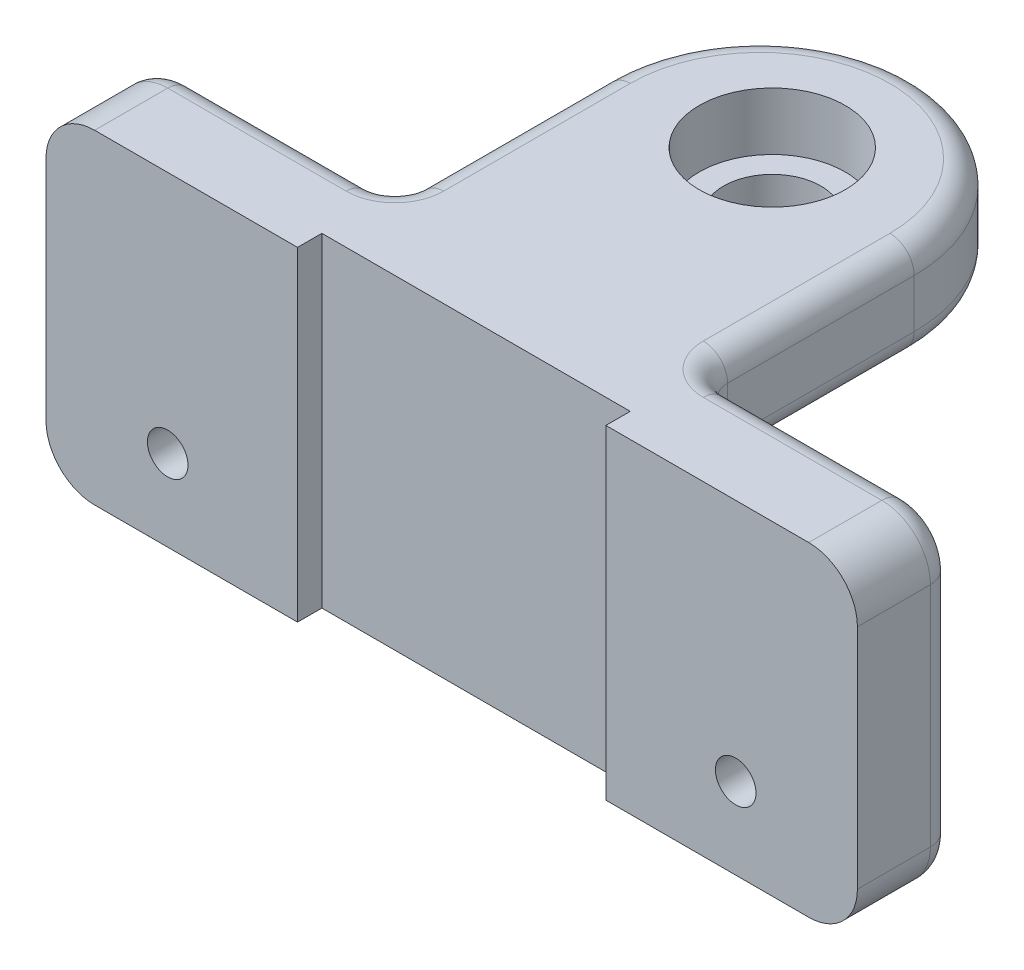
ISO-10303-21;
HEADER;
FILE_DESCRIPTION(('STEP AP214'),'2;1');
FILE_NAME('part.step','',(''),(''),'','','');
FILE_SCHEMA(('AUTOMOTIVE_DESIGN { 1 0 10303 214 1 1 1 1 }'));
ENDSEC;
DATA;
#1=APPLICATION_CONTEXT('core data for automotive mechanical design processes');
#2=APPLICATION_PROTOCOL_DEFINITION('international standard','automotive_design',2000,#1);
#3=PRODUCT_CONTEXT('',#1,'mechanical');
#4=PRODUCT('Part','Part','',(#3));
#5=PRODUCT_RELATED_PRODUCT_CATEGORY('part','',(#4));
#6=PRODUCT_DEFINITION_FORMATION('','',#4);
#7=PRODUCT_DEFINITION_CONTEXT('part definition',#1,'design');
#8=PRODUCT_DEFINITION('design','',#6,#7);
#9=PRODUCT_DEFINITION_SHAPE('','',#8);
#10=(LENGTH_UNIT() NAMED_UNIT(*) SI_UNIT(.MILLI.,.METRE.));
#11=(NAMED_UNIT(*) PLANE_ANGLE_UNIT() SI_UNIT($,.RADIAN.));
#12=(NAMED_UNIT(*) SI_UNIT($,.STERADIAN.) SOLID_ANGLE_UNIT());
#13=UNCERTAINTY_MEASURE_WITH_UNIT(LENGTH_MEASURE(1.E-05),#10,'distance_accuracy_value','');
#14=(GEOMETRIC_REPRESENTATION_CONTEXT(3) GLOBAL_UNCERTAINTY_ASSIGNED_CONTEXT((#13)) GLOBAL_UNIT_ASSIGNED_CONTEXT((#10,
#11,#12)) REPRESENTATION_CONTEXT('',''));
#15=CARTESIAN_POINT('',(0.,0.,0.));
#16=DIRECTION('',(0.,0.,1.));
#17=DIRECTION('',(1.,0.,0.));
#18=AXIS2_PLACEMENT_3D('',#15,#16,#17);
#19=CARTESIAN_POINT('',(6.,6.,12.));
#20=DIRECTION('',(0.,0.,1.));
#21=DIRECTION('',(1.,0.,0.));
#22=AXIS2_PLACEMENT_3D('',#19,#20,#21);
#23=CYLINDRICAL_SURFACE('',#22,6.);
#24=DIRECTION('',(0.,0.,1.));
#25=VECTOR('',#24,1.);
#26=CARTESIAN_POINT('',(0.,6.,12.));
#27=LINE('',#26,#25);
#28=CARTESIAN_POINT('',(0.,6.,3.));
#29=VERTEX_POINT('',#28);
#30=CARTESIAN_POINT('',(0.,6.00000000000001,12.));
#31=VERTEX_POINT('',#30);
#32=EDGE_CURVE('E337',#29,#31,#27,.T.);
#33=ORIENTED_EDGE('',*,*,#32,.F.);
#34=CARTESIAN_POINT('',(6.,6.,3.));
#35=DIRECTION('',(0.,0.,1.));
#36=DIRECTION('',(1.,0.,0.));
#37=AXIS2_PLACEMENT_3D('',#34,#35,#36);
#38=CIRCLE('',#37,6.);
#39=CARTESIAN_POINT('',(6.,0.,3.));
#40=VERTEX_POINT('',#39);
#41=EDGE_CURVE('E59',#29,#40,#38,.T.);
#42=ORIENTED_EDGE('',*,*,#41,.T.);
#43=DIRECTION('',(0.,0.,1.));
#44=VECTOR('',#43,1.);
#45=CARTESIAN_POINT('',(6.,0.,12.));
#46=LINE('',#45,#44);
#47=CARTESIAN_POINT('',(6.,0.,12.));
#48=VERTEX_POINT('',#47);
#49=EDGE_CURVE('E340',#48,#40,#46,.F.);
#50=ORIENTED_EDGE('',*,*,#49,.F.);
#51=CARTESIAN_POINT('',(6.,6.,12.));
#52=DIRECTION('',(0.,0.,1.));
#53=DIRECTION('',(1.,0.,0.));
#54=AXIS2_PLACEMENT_3D('',#51,#52,#53);
#55=CIRCLE('',#54,6.);
#56=EDGE_CURVE('E343',#31,#48,#55,.T.);
#57=ORIENTED_EDGE('',*,*,#56,.F.);
#58=EDGE_LOOP('',(#33,#42,#50,#57));
#59=FACE_BOUND('',#58,.T.);
#60=ADVANCED_FACE('F41',(#59),#23,.T.);
#61=CARTESIAN_POINT('',(6.,34.,12.));
#62=DIRECTION('',(0.,0.,1.));
#63=DIRECTION('',(1.,0.,0.));
#64=AXIS2_PLACEMENT_3D('',#61,#62,#63);
#65=CYLINDRICAL_SURFACE('',#64,6.);
#66=DIRECTION('',(0.,0.,1.));
#67=VECTOR('',#66,1.);
#68=CARTESIAN_POINT('',(6.,40.,12.));
#69=LINE('',#68,#67);
#70=CARTESIAN_POINT('',(6.,40.,3.));
#71=VERTEX_POINT('',#70);
#72=CARTESIAN_POINT('',(6.,40.,12.));
#73=VERTEX_POINT('',#72);
#74=EDGE_CURVE('E328',#71,#73,#69,.T.);
#75=ORIENTED_EDGE('',*,*,#74,.F.);
#76=CARTESIAN_POINT('',(6.,34.,3.));
#77=DIRECTION('',(0.,0.,1.));
#78=DIRECTION('',(1.,0.,0.));
#79=AXIS2_PLACEMENT_3D('',#76,#77,#78);
#80=CIRCLE('',#79,6.);
#81=CARTESIAN_POINT('',(0.,34.,3.));
#82=VERTEX_POINT('',#81);
#83=EDGE_CURVE('E452',#71,#82,#80,.T.);
#84=ORIENTED_EDGE('',*,*,#83,.T.);
#85=DIRECTION('',(0.,0.,1.));
#86=VECTOR('',#85,1.);
#87=CARTESIAN_POINT('',(0.,34.,12.));
#88=LINE('',#87,#86);
#89=CARTESIAN_POINT('',(0.,34.,12.));
#90=VERTEX_POINT('',#89);
#91=EDGE_CURVE('E331',#90,#82,#88,.F.);
#92=ORIENTED_EDGE('',*,*,#91,.F.);
#93=CARTESIAN_POINT('',(6.,34.,12.));
#94=DIRECTION('',(0.,0.,1.));
#95=DIRECTION('',(1.,0.,0.));
#96=AXIS2_PLACEMENT_3D('',#93,#94,#95);
#97=CIRCLE('',#96,6.);
#98=EDGE_CURVE('E334',#73,#90,#97,.T.);
#99=ORIENTED_EDGE('',*,*,#98,.F.);
#100=EDGE_LOOP('',(#75,#84,#92,#99));
#101=FACE_BOUND('',#100,.T.);
#102=ADVANCED_FACE('F716',(#101),#65,.T.);
#103=CARTESIAN_POINT('',(94.,34.,12.));
#104=DIRECTION('',(0.,0.,-1.));
#105=DIRECTION('',(-1.,0.,0.));
#106=AXIS2_PLACEMENT_3D('',#103,#104,#105);
#107=CYLINDRICAL_SURFACE('',#106,6.);
#108=DIRECTION('',(0.,0.,-1.));
#109=VECTOR('',#108,1.);
#110=CARTESIAN_POINT('',(100.,34.,12.));
#111=LINE('',#110,#109);
#112=CARTESIAN_POINT('',(100.,34.,3.));
#113=VERTEX_POINT('',#112);
#114=CARTESIAN_POINT('',(100.,34.,12.));
#115=VERTEX_POINT('',#114);
#116=EDGE_CURVE('E322',#113,#115,#111,.F.);
#117=ORIENTED_EDGE('',*,*,#116,.F.);
#118=CARTESIAN_POINT('',(94.,34.,3.));
#119=DIRECTION('',(0.,0.,1.));
#120=DIRECTION('',(1.,0.,0.));
#121=AXIS2_PLACEMENT_3D('',#118,#119,#120);
#122=CIRCLE('',#121,6.);
#123=CARTESIAN_POINT('',(94.,40.,3.));
#124=VERTEX_POINT('',#123);
#125=EDGE_CURVE('E455',#113,#124,#122,.T.);
#126=ORIENTED_EDGE('',*,*,#125,.T.);
#127=DIRECTION('',(0.,0.,-1.));
#128=VECTOR('',#127,1.);
#129=CARTESIAN_POINT('',(94.,40.,12.));
#130=LINE('',#129,#128);
#131=CARTESIAN_POINT('',(94.,40.,12.));
#132=VERTEX_POINT('',#131);
#133=EDGE_CURVE('E318',#132,#124,#130,.T.);
#134=ORIENTED_EDGE('',*,*,#133,.F.);
#135=CARTESIAN_POINT('',(94.,34.,12.));
#136=DIRECTION('',(0.,0.,1.));
#137=DIRECTION('',(1.,0.,0.));
#138=AXIS2_PLACEMENT_3D('',#135,#136,#137);
#139=CIRCLE('',#138,6.);
#140=EDGE_CURVE('E325',#115,#132,#139,.T.);
#141=ORIENTED_EDGE('',*,*,#140,.F.);
#142=EDGE_LOOP('',(#117,#126,#134,#141));
#143=FACE_BOUND('',#142,.T.);
#144=ADVANCED_FACE('F677',(#143),#107,.T.);
#145=CARTESIAN_POINT('',(94.,6.,12.));
#146=DIRECTION('',(0.,0.,-1.));
#147=DIRECTION('',(-1.,0.,0.));
#148=AXIS2_PLACEMENT_3D('',#145,#146,#147);
#149=CYLINDRICAL_SURFACE('',#148,6.);
#150=DIRECTION('',(0.,0.,-1.));
#151=VECTOR('',#150,1.);
#152=CARTESIAN_POINT('',(94.,0.,12.));
#153=LINE('',#152,#151);
#154=CARTESIAN_POINT('',(94.,0.,3.));
#155=VERTEX_POINT('',#154);
#156=CARTESIAN_POINT('',(94.,0.,12.));
#157=VERTEX_POINT('',#156);
#158=EDGE_CURVE('E312',#155,#157,#153,.F.);
#159=ORIENTED_EDGE('',*,*,#158,.F.);
#160=CARTESIAN_POINT('',(94.,6.,3.));
#161=DIRECTION('',(0.,0.,1.));
#162=DIRECTION('',(1.,0.,0.));
#163=AXIS2_PLACEMENT_3D('',#160,#161,#162);
#164=CIRCLE('',#163,6.);
#165=CARTESIAN_POINT('',(100.,6.,3.));
#166=VERTEX_POINT('',#165);
#167=EDGE_CURVE('E461',#155,#166,#164,.T.);
#168=ORIENTED_EDGE('',*,*,#167,.T.);
#169=DIRECTION('',(0.,0.,-1.));
#170=VECTOR('',#169,1.);
#171=CARTESIAN_POINT('',(100.,6.,12.));
#172=LINE('',#171,#170);
#173=CARTESIAN_POINT('',(100.,6.00000000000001,12.));
#174=VERTEX_POINT('',#173);
#175=EDGE_CURVE('E305',#174,#166,#172,.T.);
#176=ORIENTED_EDGE('',*,*,#175,.F.);
#177=CARTESIAN_POINT('',(94.,6.,12.));
#178=DIRECTION('',(0.,0.,1.));
#179=DIRECTION('',(1.,0.,0.));
#180=AXIS2_PLACEMENT_3D('',#177,#178,#179);
#181=CIRCLE('',#180,6.);
#182=EDGE_CURVE('E315',#157,#174,#181,.T.);
#183=ORIENTED_EDGE('',*,*,#182,.F.);
#184=EDGE_LOOP('',(#159,#168,#176,#183));
#185=FACE_BOUND('',#184,.T.);
#186=ADVANCED_FACE('F813',(#185),#149,.T.);
#187=CARTESIAN_POINT('',(0.,0.,12.));
#188=DIRECTION('',(0.,0.,1.));
#189=DIRECTION('',(1.,0.,0.));
#190=AXIS2_PLACEMENT_3D('',#187,#188,#189);
#191=PLANE('',#190);
#192=CARTESIAN_POINT('',(85.,10.,12.));
#193=DIRECTION('',(0.,0.,-1.));
#194=DIRECTION('',(-1.,0.,0.));
#195=AXIS2_PLACEMENT_3D('',#192,#193,#194);
#196=CIRCLE('',#195,2.5);
#197=CARTESIAN_POINT('',(82.5,10.,12.));
#198=VERTEX_POINT('',#197);
#199=EDGE_CURVE('E576',#198,#198,#196,.T.);
#200=ORIENTED_EDGE('',*,*,#199,.T.);
#201=EDGE_LOOP('',(#200));
#202=FACE_BOUND('',#201,.T.);
#203=DIRECTION('',(0.,1.,0.));
#204=VECTOR('',#203,1.);
#205=CARTESIAN_POINT('',(100.,40.,12.));
#206=LINE('',#205,#204);
#207=EDGE_CURVE('E297',#174,#115,#206,.T.);
#208=ORIENTED_EDGE('',*,*,#207,.T.);
#209=ORIENTED_EDGE('',*,*,#140,.T.);
#210=DIRECTION('',(-1.,0.,0.));
#211=VECTOR('',#210,1.);
#212=CARTESIAN_POINT('',(0.,40.,12.));
#213=LINE('',#212,#211);
#214=CARTESIAN_POINT('',(69.,40.,12.));
#215=VERTEX_POINT('',#214);
#216=EDGE_CURVE('E302',#132,#215,#213,.T.);
#217=ORIENTED_EDGE('',*,*,#216,.T.);
#218=DIRECTION('',(0.,1.,0.));
#219=VECTOR('',#218,1.);
#220=CARTESIAN_POINT('',(69.,0.,12.));
#221=LINE('',#220,#219);
#222=CARTESIAN_POINT('',(69.,0.,12.));
#223=VERTEX_POINT('',#222);
#224=EDGE_CURVE('E251',#223,#215,#221,.T.);
#225=ORIENTED_EDGE('',*,*,#224,.F.);
#226=DIRECTION('',(1.,0.,0.));
#227=VECTOR('',#226,1.);
#228=CARTESIAN_POINT('',(0.,0.,12.));
#229=LINE('',#228,#227);
#230=EDGE_CURVE('E256',#223,#157,#229,.T.);
#231=ORIENTED_EDGE('',*,*,#230,.T.);
#232=ORIENTED_EDGE('',*,*,#182,.T.);
#233=EDGE_LOOP('',(#208,#209,#217,#225,#231,#232));
#234=FACE_BOUND('',#233,.T.);
#235=ADVANCED_FACE('F607',(#202,#234),#191,.T.);
#236=CARTESIAN_POINT('',(0.,0.,0.));
#237=DIRECTION('',(0.,0.,1.));
#238=DIRECTION('',(1.,0.,0.));
#239=AXIS2_PLACEMENT_3D('',#236,#237,#238);
#240=PLANE('',#239);
#241=CARTESIAN_POINT('',(15.,10.,0.));
#242=DIRECTION('',(0.,0.,-1.));
#243=DIRECTION('',(-1.,0.,0.));
#244=AXIS2_PLACEMENT_3D('',#241,#242,#243);
#245=CIRCLE('',#244,2.5);
#246=CARTESIAN_POINT('',(12.5,10.,0.));
#247=VERTEX_POINT('',#246);
#248=EDGE_CURVE('E584',#247,#247,#245,.T.);
#249=ORIENTED_EDGE('',*,*,#248,.F.);
#250=EDGE_LOOP('',(#249));
#251=FACE_BOUND('',#250,.T.);
#252=CARTESIAN_POINT('',(85.,10.,0.));
#253=DIRECTION('',(0.,0.,-1.));
#254=DIRECTION('',(-1.,0.,0.));
#255=AXIS2_PLACEMENT_3D('',#252,#253,#254);
#256=CIRCLE('',#255,2.5);
#257=CARTESIAN_POINT('',(82.5,10.,0.));
#258=VERTEX_POINT('',#257);
#259=EDGE_CURVE('E580',#258,#258,#256,.T.);
#260=ORIENTED_EDGE('',*,*,#259,.F.);
#261=EDGE_LOOP('',(#260));
#262=FACE_BOUND('',#261,.T.);
#263=CARTESIAN_POINT('',(6.,34.,0.));
#264=DIRECTION('',(0.,0.,1.));
#265=DIRECTION('',(1.,0.,0.));
#266=AXIS2_PLACEMENT_3D('',#263,#264,#265);
#267=CIRCLE('',#266,3.);
#268=CARTESIAN_POINT('',(3.,34.,0.));
#269=VERTEX_POINT('',#268);
#270=CARTESIAN_POINT('',(6.,37.,0.));
#271=VERTEX_POINT('',#270);
#272=EDGE_CURVE('E380',#269,#271,#267,.F.);
#273=ORIENTED_EDGE('',*,*,#272,.T.);
#274=DIRECTION('',(-1.,0.,0.));
#275=VECTOR('',#274,1.);
#276=CARTESIAN_POINT('',(0.,37.,0.));
#277=LINE('',#276,#275);
#278=CARTESIAN_POINT('',(28.,37.,0.));
#279=VERTEX_POINT('',#278);
#280=EDGE_CURVE('E398',#271,#279,#277,.F.);
#281=ORIENTED_EDGE('',*,*,#280,.T.);
#282=DIRECTION('',(0.,1.,0.));
#283=VECTOR('',#282,1.);
#284=CARTESIAN_POINT('',(28.,0.,0.));
#285=LINE('',#284,#283);
#286=CARTESIAN_POINT('',(28.,31.,0.));
#287=VERTEX_POINT('',#286);
#288=EDGE_CURVE('E394',#279,#287,#285,.F.);
#289=ORIENTED_EDGE('',*,*,#288,.T.);
#290=CARTESIAN_POINT('',(34.,31.,0.));
#291=DIRECTION('',(0.,0.,1.));
#292=DIRECTION('',(1.,0.,0.));
#293=AXIS2_PLACEMENT_3D('',#290,#291,#292);
#294=CIRCLE('',#293,6.);
#295=CARTESIAN_POINT('',(34.,25.,0.));
#296=VERTEX_POINT('',#295);
#297=EDGE_CURVE('E390',#296,#287,#294,.F.);
#298=ORIENTED_EDGE('',*,*,#297,.F.);
#299=DIRECTION('',(1.,0.,0.));
#300=VECTOR('',#299,1.);
#301=CARTESIAN_POINT('',(0.,25.,0.));
#302=LINE('',#301,#300);
#303=CARTESIAN_POINT('',(66.,25.,0.));
#304=VERTEX_POINT('',#303);
#305=EDGE_CURVE('E387',#296,#304,#302,.T.);
#306=ORIENTED_EDGE('',*,*,#305,.T.);
#307=CARTESIAN_POINT('',(66.,31.,0.));
#308=DIRECTION('',(0.,0.,1.));
#309=DIRECTION('',(1.,0.,0.));
#310=AXIS2_PLACEMENT_3D('',#307,#308,#309);
#311=CIRCLE('',#310,6.);
#312=CARTESIAN_POINT('',(72.,31.,0.));
#313=VERTEX_POINT('',#312);
#314=EDGE_CURVE('E383',#313,#304,#311,.F.);
#315=ORIENTED_EDGE('',*,*,#314,.F.);
#316=DIRECTION('',(0.,1.,0.));
#317=VECTOR('',#316,1.);
#318=CARTESIAN_POINT('',(72.,0.,0.));
#319=LINE('',#318,#317);
#320=CARTESIAN_POINT('',(72.,37.,0.));
#321=VERTEX_POINT('',#320);
#322=EDGE_CURVE('E374',#313,#321,#319,.T.);
#323=ORIENTED_EDGE('',*,*,#322,.T.);
#324=DIRECTION('',(-1.,0.,0.));
#325=VECTOR('',#324,1.);
#326=CARTESIAN_POINT('',(0.,37.,0.));
#327=LINE('',#326,#325);
#328=CARTESIAN_POINT('',(94.,37.,0.));
#329=VERTEX_POINT('',#328);
#330=EDGE_CURVE('E371',#321,#329,#327,.F.);
#331=ORIENTED_EDGE('',*,*,#330,.T.);
#332=CARTESIAN_POINT('',(94.,34.,0.));
#333=DIRECTION('',(0.,0.,1.));
#334=DIRECTION('',(1.,0.,0.));
#335=AXIS2_PLACEMENT_3D('',#332,#333,#334);
#336=CIRCLE('',#335,3.);
#337=CARTESIAN_POINT('',(97.,34.,0.));
#338=VERTEX_POINT('',#337);
#339=EDGE_CURVE('E368',#329,#338,#336,.F.);
#340=ORIENTED_EDGE('',*,*,#339,.T.);
#341=DIRECTION('',(0.,1.,0.));
#342=VECTOR('',#341,1.);
#343=CARTESIAN_POINT('',(97.,0.,0.));
#344=LINE('',#343,#342);
#345=CARTESIAN_POINT('',(97.,6.,0.));
#346=VERTEX_POINT('',#345);
#347=EDGE_CURVE('E365',#338,#346,#344,.F.);
#348=ORIENTED_EDGE('',*,*,#347,.T.);
#349=CARTESIAN_POINT('',(94.,6.,0.));
#350=DIRECTION('',(0.,0.,1.));
#351=DIRECTION('',(1.,0.,0.));
#352=AXIS2_PLACEMENT_3D('',#349,#350,#351);
#353=CIRCLE('',#352,3.);
#354=CARTESIAN_POINT('',(94.,3.,0.));
#355=VERTEX_POINT('',#354);
#356=EDGE_CURVE('E362',#346,#355,#353,.F.);
#357=ORIENTED_EDGE('',*,*,#356,.T.);
#358=DIRECTION('',(1.,0.,0.));
#359=VECTOR('',#358,1.);
#360=CARTESIAN_POINT('',(0.,3.,0.));
#361=LINE('',#360,#359);
#362=CARTESIAN_POINT('',(6.,3.,0.));
#363=VERTEX_POINT('',#362);
#364=EDGE_CURVE('E356',#355,#363,#361,.F.);
#365=ORIENTED_EDGE('',*,*,#364,.T.);
#366=CARTESIAN_POINT('',(6.,6.,0.));
#367=DIRECTION('',(0.,0.,1.));
#368=DIRECTION('',(1.,0.,0.));
#369=AXIS2_PLACEMENT_3D('',#366,#367,#368);
#370=CIRCLE('',#369,3.);
#371=CARTESIAN_POINT('',(3.,6.,0.));
#372=VERTEX_POINT('',#371);
#373=EDGE_CURVE('E359',#363,#372,#370,.F.);
#374=ORIENTED_EDGE('',*,*,#373,.T.);
#375=DIRECTION('',(0.,-1.,0.));
#376=VECTOR('',#375,1.);
#377=CARTESIAN_POINT('',(3.,0.,0.));
#378=LINE('',#377,#376);
#379=EDGE_CURVE('E377',#372,#269,#378,.F.);
#380=ORIENTED_EDGE('',*,*,#379,.T.);
#381=EDGE_LOOP('',(#273,#281,#289,#298,#306,#315,#323,#331,#340,#348,#357,#365,#374,#380));
#382=FACE_BOUND('',#381,.T.);
#383=ADVANCED_FACE('F603',(#251,#262,#382),#240,.F.);
#384=CARTESIAN_POINT('',(0.,40.,12.));
#385=DIRECTION('',(1.,0.,0.));
#386=DIRECTION('',(0.,0.,-1.));
#387=AXIS2_PLACEMENT_3D('',#384,#385,#386);
#388=PLANE('',#387);
#389=ORIENTED_EDGE('',*,*,#91,.T.);
#390=DIRECTION('',(0.,-1.,0.));
#391=VECTOR('',#390,1.);
#392=CARTESIAN_POINT('',(0.,40.,3.));
#393=LINE('',#392,#391);
#394=EDGE_CURVE('E51',#82,#29,#393,.T.);
#395=ORIENTED_EDGE('',*,*,#394,.T.);
#396=ORIENTED_EDGE('',*,*,#32,.T.);
#397=DIRECTION('',(0.,-1.,0.));
#398=VECTOR('',#397,1.);
#399=CARTESIAN_POINT('',(0.,40.,12.));
#400=LINE('',#399,#398);
#401=EDGE_CURVE('E287',#90,#31,#400,.T.);
#402=ORIENTED_EDGE('',*,*,#401,.F.);
#403=EDGE_LOOP('',(#389,#395,#396,#402));
#404=FACE_BOUND('',#403,.T.);
#405=ADVANCED_FACE('F606',(#404),#388,.F.);
#406=CARTESIAN_POINT('',(0.,0.,12.));
#407=DIRECTION('',(0.,1.,0.));
#408=DIRECTION('',(0.,0.,1.));
#409=AXIS2_PLACEMENT_3D('',#406,#407,#408);
#410=PLANE('',#409);
#411=ORIENTED_EDGE('',*,*,#49,.T.);
#412=DIRECTION('',(1.,0.,0.));
#413=VECTOR('',#412,1.);
#414=CARTESIAN_POINT('',(0.,0.,3.));
#415=LINE('',#414,#413);
#416=EDGE_CURVE('E11',#40,#155,#415,.T.);
#417=ORIENTED_EDGE('',*,*,#416,.T.);
#418=ORIENTED_EDGE('',*,*,#158,.T.);
#419=ORIENTED_EDGE('',*,*,#230,.F.);
#420=DIRECTION('',(0.,0.,1.));
#421=VECTOR('',#420,1.);
#422=CARTESIAN_POINT('',(69.,0.,8.99999999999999));
#423=LINE('',#422,#421);
#424=CARTESIAN_POINT('',(69.,0.,8.99999999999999));
#425=VERTEX_POINT('',#424);
#426=EDGE_CURVE('E241',#425,#223,#423,.T.);
#427=ORIENTED_EDGE('',*,*,#426,.F.);
#428=DIRECTION('',(1.,0.,0.));
#429=VECTOR('',#428,1.);
#430=CARTESIAN_POINT('',(31.,0.,9.));
#431=LINE('',#430,#429);
#432=CARTESIAN_POINT('',(31.,0.,9.));
#433=VERTEX_POINT('',#432);
#434=EDGE_CURVE('E228',#433,#425,#431,.T.);
#435=ORIENTED_EDGE('',*,*,#434,.F.);
#436=DIRECTION('',(0.,0.,1.));
#437=VECTOR('',#436,1.);
#438=CARTESIAN_POINT('',(31.,0.,9.));
#439=LINE('',#438,#437);
#440=CARTESIAN_POINT('',(31.,0.,12.));
#441=VERTEX_POINT('',#440);
#442=EDGE_CURVE('E240',#433,#441,#439,.T.);
#443=ORIENTED_EDGE('',*,*,#442,.T.);
#444=EDGE_CURVE('E294',#48,#441,#229,.T.);
#445=ORIENTED_EDGE('',*,*,#444,.F.);
#446=EDGE_LOOP('',(#411,#417,#418,#419,#427,#435,#443,#445));
#447=FACE_BOUND('',#446,.T.);
#448=ADVANCED_FACE('F254',(#447),#410,.F.);
#449=CARTESIAN_POINT('',(100.,40.,12.));
#450=DIRECTION('',(-1.,0.,0.));
#451=DIRECTION('',(0.,-1.,0.));
#452=AXIS2_PLACEMENT_3D('',#449,#450,#451);
#453=PLANE('',#452);
#454=ORIENTED_EDGE('',*,*,#175,.T.);
#455=DIRECTION('',(0.,1.,0.));
#456=VECTOR('',#455,1.);
#457=CARTESIAN_POINT('',(100.,40.,3.));
#458=LINE('',#457,#456);
#459=EDGE_CURVE('E458',#166,#113,#458,.T.);
#460=ORIENTED_EDGE('',*,*,#459,.T.);
#461=ORIENTED_EDGE('',*,*,#116,.T.);
#462=ORIENTED_EDGE('',*,*,#207,.F.);
#463=EDGE_LOOP('',(#454,#460,#461,#462));
#464=FACE_BOUND('',#463,.T.);
#465=ADVANCED_FACE('F687',(#464),#453,.F.);
#466=CARTESIAN_POINT('',(0.,40.,12.));
#467=DIRECTION('',(0.,-1.,0.));
#468=DIRECTION('',(0.,0.,-1.));
#469=AXIS2_PLACEMENT_3D('',#466,#467,#468);
#470=PLANE('',#469);
#471=CARTESIAN_POINT('',(49.5993036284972,40.,-27.9057684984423));
#472=DIRECTION('',(0.,1.,0.));
#473=DIRECTION('',(0.,0.,1.));
#474=AXIS2_PLACEMENT_3D('',#471,#472,#473);
#475=CIRCLE('',#474,8.99999999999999);
#476=CARTESIAN_POINT('',(49.5993036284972,40.,-18.9057684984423));
#477=VERTEX_POINT('',#476);
#478=EDGE_CURVE('E562',#477,#477,#475,.T.);
#479=ORIENTED_EDGE('',*,*,#478,.F.);
#480=EDGE_LOOP('',(#479));
#481=FACE_BOUND('',#480,.T.);
#482=CARTESIAN_POINT('',(28.,40.,-3.));
#483=DIRECTION('',(0.,-1.,0.));
#484=DIRECTION('',(0.,0.,-1.));
#485=AXIS2_PLACEMENT_3D('',#482,#483,#484);
#486=CIRCLE('',#485,6.);
#487=CARTESIAN_POINT('',(28.,40.,3.));
#488=VERTEX_POINT('',#487);
#489=CARTESIAN_POINT('',(34.,40.,-3.));
#490=VERTEX_POINT('',#489);
#491=EDGE_CURVE('E427',#488,#490,#486,.F.);
#492=ORIENTED_EDGE('',*,*,#491,.F.);
#493=DIRECTION('',(-1.,0.,0.));
#494=VECTOR('',#493,1.);
#495=CARTESIAN_POINT('',(0.,40.,3.));
#496=LINE('',#495,#494);
#497=EDGE_CURVE('E430',#488,#71,#496,.T.);
#498=ORIENTED_EDGE('',*,*,#497,.T.);
#499=ORIENTED_EDGE('',*,*,#74,.T.);
#500=CARTESIAN_POINT('',(31.,40.,12.));
#501=VERTEX_POINT('',#500);
#502=EDGE_CURVE('E301',#501,#73,#213,.T.);
#503=ORIENTED_EDGE('',*,*,#502,.F.);
#504=DIRECTION('',(0.,0.,1.));
#505=VECTOR('',#504,1.);
#506=CARTESIAN_POINT('',(31.,40.,9.));
#507=LINE('',#506,#505);
#508=CARTESIAN_POINT('',(31.,40.,9.));
#509=VERTEX_POINT('',#508);
#510=EDGE_CURVE('E258',#509,#501,#507,.T.);
#511=ORIENTED_EDGE('',*,*,#510,.F.);
#512=DIRECTION('',(1.,0.,0.));
#513=VECTOR('',#512,1.);
#514=CARTESIAN_POINT('',(31.,40.,9.));
#515=LINE('',#514,#513);
#516=CARTESIAN_POINT('',(69.,40.,8.99999999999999));
#517=VERTEX_POINT('',#516);
#518=EDGE_CURVE('E261',#509,#517,#515,.T.);
#519=ORIENTED_EDGE('',*,*,#518,.T.);
#520=DIRECTION('',(0.,0.,1.));
#521=VECTOR('',#520,1.);
#522=CARTESIAN_POINT('',(69.,40.,8.99999999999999));
#523=LINE('',#522,#521);
#524=EDGE_CURVE('E248',#517,#215,#523,.T.);
#525=ORIENTED_EDGE('',*,*,#524,.T.);
#526=ORIENTED_EDGE('',*,*,#216,.F.);
#527=ORIENTED_EDGE('',*,*,#133,.T.);
#528=DIRECTION('',(-1.,0.,0.));
#529=VECTOR('',#528,1.);
#530=CARTESIAN_POINT('',(0.,40.,3.));
#531=LINE('',#530,#529);
#532=CARTESIAN_POINT('',(72.,40.,3.));
#533=VERTEX_POINT('',#532);
#534=EDGE_CURVE('E414',#124,#533,#531,.T.);
#535=ORIENTED_EDGE('',*,*,#534,.T.);
#536=CARTESIAN_POINT('',(72.,40.,-3.));
#537=DIRECTION('',(0.,-1.,0.));
#538=DIRECTION('',(0.,0.,-1.));
#539=AXIS2_PLACEMENT_3D('',#536,#537,#538);
#540=CIRCLE('',#539,6.);
#541=CARTESIAN_POINT('',(66.,40.,-3.));
#542=VERTEX_POINT('',#541);
#543=EDGE_CURVE('E410',#542,#533,#540,.F.);
#544=ORIENTED_EDGE('',*,*,#543,.F.);
#545=DIRECTION('',(0.,0.,-1.));
#546=VECTOR('',#545,1.);
#547=CARTESIAN_POINT('',(66.,40.,-26.));
#548=LINE('',#547,#546);
#549=CARTESIAN_POINT('',(66.,40.,-26.));
#550=VERTEX_POINT('',#549);
#551=EDGE_CURVE('E417',#542,#550,#548,.T.);
#552=ORIENTED_EDGE('',*,*,#551,.T.);
#553=CARTESIAN_POINT('',(50.,40.,-26.));
#554=DIRECTION('',(0.,-1.,0.));
#555=DIRECTION('',(0.,0.,-1.));
#556=AXIS2_PLACEMENT_3D('',#553,#554,#555);
#557=CIRCLE('',#556,16.);
#558=CARTESIAN_POINT('',(34.,40.,-26.));
#559=VERTEX_POINT('',#558);
#560=EDGE_CURVE('E420',#550,#559,#557,.F.);
#561=ORIENTED_EDGE('',*,*,#560,.T.);
#562=DIRECTION('',(0.,0.,1.));
#563=VECTOR('',#562,1.);
#564=CARTESIAN_POINT('',(34.,40.,0.));
#565=LINE('',#564,#563);
#566=EDGE_CURVE('E423',#559,#490,#565,.T.);
#567=ORIENTED_EDGE('',*,*,#566,.T.);
#568=EDGE_LOOP('',(#492,#498,#499,#503,#511,#519,#525,#526,#527,#535,#544,#552,#561,#567));
#569=FACE_BOUND('',#568,.T.);
#570=ADVANCED_FACE('F681',(#481,#569),#470,.F.);
#571=CARTESIAN_POINT('',(15.,10.,12.));
#572=DIRECTION('',(0.,0.,-1.));
#573=DIRECTION('',(-1.,0.,0.));
#574=AXIS2_PLACEMENT_3D('',#571,#572,#573);
#575=CIRCLE('',#574,2.5);
#576=CARTESIAN_POINT('',(12.5,10.,12.));
#577=VERTEX_POINT('',#576);
#578=EDGE_CURVE('E472',#577,#577,#575,.T.);
#579=ORIENTED_EDGE('',*,*,#578,.T.);
#580=EDGE_LOOP('',(#579));
#581=FACE_BOUND('',#580,.T.);
#582=ORIENTED_EDGE('',*,*,#401,.T.);
#583=ORIENTED_EDGE('',*,*,#56,.T.);
#584=ORIENTED_EDGE('',*,*,#444,.T.);
#585=DIRECTION('',(0.,1.,0.));
#586=VECTOR('',#585,1.);
#587=CARTESIAN_POINT('',(31.,0.,12.));
#588=LINE('',#587,#586);
#589=EDGE_CURVE('E274',#441,#501,#588,.T.);
#590=ORIENTED_EDGE('',*,*,#589,.T.);
#591=ORIENTED_EDGE('',*,*,#502,.T.);
#592=ORIENTED_EDGE('',*,*,#98,.T.);
#593=EDGE_LOOP('',(#582,#583,#584,#590,#591,#592));
#594=FACE_BOUND('',#593,.T.);
#595=ADVANCED_FACE('F592',(#581,#594),#191,.T.);
#596=CARTESIAN_POINT('',(31.,28.,0.));
#597=DIRECTION('',(-1.,0.,0.));
#598=DIRECTION('',(0.,0.,1.));
#599=AXIS2_PLACEMENT_3D('',#596,#597,#598);
#600=PLANE('',#599);
#601=DIRECTION('',(0.,1.,0.));
#602=VECTOR('',#601,1.);
#603=CARTESIAN_POINT('',(31.,28.,-3.));
#604=LINE('',#603,#602);
#605=CARTESIAN_POINT('',(31.,31.,-3.));
#606=VERTEX_POINT('',#605);
#607=CARTESIAN_POINT('',(31.,37.,-3.));
#608=VERTEX_POINT('',#607);
#609=EDGE_CURVE('E349',#606,#608,#604,.T.);
#610=ORIENTED_EDGE('',*,*,#609,.T.);
#611=DIRECTION('',(0.,0.,1.));
#612=VECTOR('',#611,1.);
#613=CARTESIAN_POINT('',(31.,37.,-26.));
#614=LINE('',#613,#612);
#615=CARTESIAN_POINT('',(31.,37.,-26.));
#616=VERTEX_POINT('',#615);
#617=EDGE_CURVE('E353',#608,#616,#614,.F.);
#618=ORIENTED_EDGE('',*,*,#617,.T.);
#619=DIRECTION('',(0.,1.,0.));
#620=VECTOR('',#619,1.);
#621=CARTESIAN_POINT('',(31.,28.,-26.));
#622=LINE('',#621,#620);
#623=CARTESIAN_POINT('',(31.,31.,-26.));
#624=VERTEX_POINT('',#623);
#625=EDGE_CURVE('E283',#624,#616,#622,.T.);
#626=ORIENTED_EDGE('',*,*,#625,.F.);
#627=DIRECTION('',(0.,0.,1.));
#628=VECTOR('',#627,1.);
#629=CARTESIAN_POINT('',(31.,31.,0.));
#630=LINE('',#629,#628);
#631=EDGE_CURVE('E346',#624,#606,#630,.T.);
#632=ORIENTED_EDGE('',*,*,#631,.T.);
#633=EDGE_LOOP('',(#610,#618,#626,#632));
#634=FACE_BOUND('',#633,.T.);
#635=ADVANCED_FACE('F638',(#634),#600,.T.);
#636=CARTESIAN_POINT('',(50.,28.,-26.));
#637=DIRECTION('',(0.,1.,0.));
#638=DIRECTION('',(0.,0.,1.));
#639=AXIS2_PLACEMENT_3D('',#636,#637,#638);
#640=CYLINDRICAL_SURFACE('',#639,19.);
#641=ORIENTED_EDGE('',*,*,#625,.T.);
#642=CARTESIAN_POINT('',(50.,37.,-26.));
#643=DIRECTION('',(0.,-1.,0.));
#644=DIRECTION('',(0.,0.,-1.));
#645=AXIS2_PLACEMENT_3D('',#642,#643,#644);
#646=CIRCLE('',#645,19.);
#647=CARTESIAN_POINT('',(69.,37.,-26.));
#648=VERTEX_POINT('',#647);
#649=EDGE_CURVE('E436',#616,#648,#646,.T.);
#650=ORIENTED_EDGE('',*,*,#649,.T.);
#651=DIRECTION('',(0.,1.,0.));
#652=VECTOR('',#651,1.);
#653=CARTESIAN_POINT('',(69.,28.,-26.));
#654=LINE('',#653,#652);
#655=CARTESIAN_POINT('',(69.,31.,-26.));
#656=VERTEX_POINT('',#655);
#657=EDGE_CURVE('E278',#656,#648,#654,.T.);
#658=ORIENTED_EDGE('',*,*,#657,.F.);
#659=CARTESIAN_POINT('',(50.,31.,-26.));
#660=DIRECTION('',(0.,-1.,0.));
#661=DIRECTION('',(0.,0.,-1.));
#662=AXIS2_PLACEMENT_3D('',#659,#660,#661);
#663=CIRCLE('',#662,19.);
#664=EDGE_CURVE('E433',#656,#624,#663,.F.);
#665=ORIENTED_EDGE('',*,*,#664,.T.);
#666=EDGE_LOOP('',(#641,#650,#658,#665));
#667=FACE_BOUND('',#666,.T.);
#668=ADVANCED_FACE('F795',(#667),#640,.T.);
#669=CARTESIAN_POINT('',(69.,28.,-26.));
#670=DIRECTION('',(1.,0.,0.));
#671=DIRECTION('',(0.,0.,-1.));
#672=AXIS2_PLACEMENT_3D('',#669,#670,#671);
#673=PLANE('',#672);
#674=ORIENTED_EDGE('',*,*,#657,.T.);
#675=DIRECTION('',(0.,0.,-1.));
#676=VECTOR('',#675,1.);
#677=CARTESIAN_POINT('',(69.,37.,0.));
#678=LINE('',#677,#676);
#679=CARTESIAN_POINT('',(69.,37.,-3.));
#680=VERTEX_POINT('',#679);
#681=EDGE_CURVE('E407',#648,#680,#678,.F.);
#682=ORIENTED_EDGE('',*,*,#681,.T.);
#683=DIRECTION('',(0.,1.,0.));
#684=VECTOR('',#683,1.);
#685=CARTESIAN_POINT('',(69.,28.,-3.));
#686=LINE('',#685,#684);
#687=CARTESIAN_POINT('',(69.,31.,-3.));
#688=VERTEX_POINT('',#687);
#689=EDGE_CURVE('E404',#680,#688,#686,.F.);
#690=ORIENTED_EDGE('',*,*,#689,.T.);
#691=DIRECTION('',(0.,0.,-1.));
#692=VECTOR('',#691,1.);
#693=CARTESIAN_POINT('',(69.,31.,-26.));
#694=LINE('',#693,#692);
#695=EDGE_CURVE('E401',#688,#656,#694,.T.);
#696=ORIENTED_EDGE('',*,*,#695,.T.);
#697=EDGE_LOOP('',(#674,#682,#690,#696));
#698=FACE_BOUND('',#697,.T.);
#699=ADVANCED_FACE('F760',(#698),#673,.T.);
#700=CARTESIAN_POINT('',(50.,28.,-26.));
#701=DIRECTION('',(0.,-1.,0.));
#702=DIRECTION('',(0.,0.,-1.));
#703=AXIS2_PLACEMENT_3D('',#700,#701,#702);
#704=PLANE('',#703);
#705=DIRECTION('',(0.,0.,1.));
#706=VECTOR('',#705,1.);
#707=CARTESIAN_POINT('',(34.,28.,-26.));
#708=LINE('',#707,#706);
#709=CARTESIAN_POINT('',(34.,28.,-3.));
#710=VERTEX_POINT('',#709);
#711=CARTESIAN_POINT('',(34.,28.,-26.));
#712=VERTEX_POINT('',#711);
#713=EDGE_CURVE('E445',#710,#712,#708,.F.);
#714=ORIENTED_EDGE('',*,*,#713,.T.);
#715=CARTESIAN_POINT('',(50.,28.,-26.));
#716=DIRECTION('',(0.,-1.,0.));
#717=DIRECTION('',(0.,0.,-1.));
#718=AXIS2_PLACEMENT_3D('',#715,#716,#717);
#719=CIRCLE('',#718,16.);
#720=CARTESIAN_POINT('',(66.,28.,-26.));
#721=VERTEX_POINT('',#720);
#722=EDGE_CURVE('E448',#712,#721,#719,.T.);
#723=ORIENTED_EDGE('',*,*,#722,.T.);
#724=DIRECTION('',(0.,0.,-1.));
#725=VECTOR('',#724,1.);
#726=CARTESIAN_POINT('',(66.,28.,-26.));
#727=LINE('',#726,#725);
#728=CARTESIAN_POINT('',(66.,28.,-3.));
#729=VERTEX_POINT('',#728);
#730=EDGE_CURVE('E439',#721,#729,#727,.F.);
#731=ORIENTED_EDGE('',*,*,#730,.T.);
#732=DIRECTION('',(1.,0.,0.));
#733=VECTOR('',#732,1.);
#734=CARTESIAN_POINT('',(50.,28.,-3.));
#735=LINE('',#734,#733);
#736=EDGE_CURVE('E442',#729,#710,#735,.F.);
#737=ORIENTED_EDGE('',*,*,#736,.T.);
#738=EDGE_LOOP('',(#714,#723,#731,#737));
#739=FACE_BOUND('',#738,.T.);
#740=CARTESIAN_POINT('',(49.5993036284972,28.,-27.9057684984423));
#741=DIRECTION('',(0.,-1.,0.));
#742=DIRECTION('',(0.,0.,-1.));
#743=AXIS2_PLACEMENT_3D('',#740,#741,#742);
#744=CIRCLE('',#743,6.);
#745=CARTESIAN_POINT('',(49.5993036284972,28.,-33.9057684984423));
#746=VERTEX_POINT('',#745);
#747=EDGE_CURVE('E271',#746,#746,#744,.T.);
#748=ORIENTED_EDGE('',*,*,#747,.F.);
#749=EDGE_LOOP('',(#748));
#750=FACE_BOUND('',#749,.T.);
#751=ADVANCED_FACE('F756',(#739,#750),#704,.T.);
#752=CARTESIAN_POINT('',(31.,0.,9.));
#753=DIRECTION('',(-1.,0.,0.));
#754=DIRECTION('',(0.,0.,1.));
#755=AXIS2_PLACEMENT_3D('',#752,#753,#754);
#756=PLANE('',#755);
#757=ORIENTED_EDGE('',*,*,#510,.T.);
#758=ORIENTED_EDGE('',*,*,#589,.F.);
#759=ORIENTED_EDGE('',*,*,#442,.F.);
#760=DIRECTION('',(0.,1.,0.));
#761=VECTOR('',#760,1.);
#762=CARTESIAN_POINT('',(31.,0.,9.));
#763=LINE('',#762,#761);
#764=EDGE_CURVE('E234',#433,#509,#763,.T.);
#765=ORIENTED_EDGE('',*,*,#764,.T.);
#766=EDGE_LOOP('',(#757,#758,#759,#765));
#767=FACE_BOUND('',#766,.T.);
#768=ADVANCED_FACE('F759',(#767),#756,.F.);
#769=CARTESIAN_POINT('',(31.,0.,9.));
#770=DIRECTION('',(0.,0.,1.));
#771=DIRECTION('',(1.,0.,0.));
#772=AXIS2_PLACEMENT_3D('',#769,#770,#771);
#773=PLANE('',#772);
#774=ORIENTED_EDGE('',*,*,#518,.F.);
#775=ORIENTED_EDGE('',*,*,#764,.F.);
#776=ORIENTED_EDGE('',*,*,#434,.T.);
#777=DIRECTION('',(0.,1.,0.));
#778=VECTOR('',#777,1.);
#779=CARTESIAN_POINT('',(69.,0.,8.99999999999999));
#780=LINE('',#779,#778);
#781=EDGE_CURVE('E232',#425,#517,#780,.T.);
#782=ORIENTED_EDGE('',*,*,#781,.T.);
#783=EDGE_LOOP('',(#774,#775,#776,#782));
#784=FACE_BOUND('',#783,.T.);
#785=ADVANCED_FACE('F231',(#784),#773,.T.);
#786=CARTESIAN_POINT('',(69.,0.,8.99999999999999));
#787=DIRECTION('',(-1.,0.,0.));
#788=DIRECTION('',(0.,0.,1.));
#789=AXIS2_PLACEMENT_3D('',#786,#787,#788);
#790=PLANE('',#789);
#791=ORIENTED_EDGE('',*,*,#524,.F.);
#792=ORIENTED_EDGE('',*,*,#781,.F.);
#793=ORIENTED_EDGE('',*,*,#426,.T.);
#794=ORIENTED_EDGE('',*,*,#224,.T.);
#795=EDGE_LOOP('',(#791,#792,#793,#794));
#796=FACE_BOUND('',#795,.T.);
#797=ADVANCED_FACE('F244',(#796),#790,.T.);
#798=CARTESIAN_POINT('',(49.5993036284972,40.,-27.9057684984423));
#799=DIRECTION('',(0.,1.,0.));
#800=DIRECTION('',(0.,0.,1.));
#801=AXIS2_PLACEMENT_3D('',#798,#799,#800);
#802=CYLINDRICAL_SURFACE('',#801,6.);
#803=ORIENTED_EDGE('',*,*,#747,.T.);
#804=EDGE_LOOP('',(#803));
#805=FACE_BOUND('',#804,.T.);
#806=CARTESIAN_POINT('',(49.5993036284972,32.9,-27.9057684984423));
#807=DIRECTION('',(0.,1.,0.));
#808=DIRECTION('',(0.,0.,1.));
#809=AXIS2_PLACEMENT_3D('',#806,#807,#808);
#810=CIRCLE('',#809,6.00000000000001);
#811=CARTESIAN_POINT('',(49.5993036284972,32.9,-21.9057684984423));
#812=VERTEX_POINT('',#811);
#813=EDGE_CURVE('E264',#812,#812,#810,.T.);
#814=ORIENTED_EDGE('',*,*,#813,.T.);
#815=EDGE_LOOP('',(#814));
#816=FACE_BOUND('',#815,.T.);
#817=ADVANCED_FACE('F764',(#805,#816),#802,.F.);
#818=CARTESIAN_POINT('',(55.5993036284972,32.9,-27.9057684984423));
#819=DIRECTION('',(0.,-1.,0.));
#820=DIRECTION('',(0.,0.,-1.));
#821=AXIS2_PLACEMENT_3D('',#818,#819,#820);
#822=PLANE('',#821);
#823=ORIENTED_EDGE('',*,*,#813,.F.);
#824=EDGE_LOOP('',(#823));
#825=FACE_BOUND('',#824,.T.);
#826=CARTESIAN_POINT('',(49.5993036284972,32.9,-27.9057684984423));
#827=DIRECTION('',(0.,1.,0.));
#828=DIRECTION('',(0.,0.,1.));
#829=AXIS2_PLACEMENT_3D('',#826,#827,#828);
#830=CIRCLE('',#829,8.99999999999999);
#831=CARTESIAN_POINT('',(49.5993036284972,32.9,-18.9057684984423));
#832=VERTEX_POINT('',#831);
#833=EDGE_CURVE('E569',#832,#832,#830,.T.);
#834=ORIENTED_EDGE('',*,*,#833,.T.);
#835=EDGE_LOOP('',(#834));
#836=FACE_BOUND('',#835,.T.);
#837=ADVANCED_FACE('F767',(#825,#836),#822,.F.);
#838=CARTESIAN_POINT('',(49.5993036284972,40.,-27.9057684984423));
#839=DIRECTION('',(0.,1.,0.));
#840=DIRECTION('',(0.,0.,1.));
#841=AXIS2_PLACEMENT_3D('',#838,#839,#840);
#842=CYLINDRICAL_SURFACE('',#841,8.99999999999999);
#843=ORIENTED_EDGE('',*,*,#833,.F.);
#844=EDGE_LOOP('',(#843));
#845=FACE_BOUND('',#844,.T.);
#846=ORIENTED_EDGE('',*,*,#478,.T.);
#847=EDGE_LOOP('',(#846));
#848=FACE_BOUND('',#847,.T.);
#849=ADVANCED_FACE('F775',(#845,#848),#842,.F.);
#850=CARTESIAN_POINT('',(97.,40.,3.));
#851=DIRECTION('',(0.,1.,0.));
#852=DIRECTION('',(-1.,0.,0.));
#853=AXIS2_PLACEMENT_3D('',#850,#851,#852);
#854=CYLINDRICAL_SURFACE('',#853,3.);
#855=CARTESIAN_POINT('',(97.,6.,3.));
#856=DIRECTION('',(0.,-1.,0.));
#857=DIRECTION('',(1.,0.,0.));
#858=AXIS2_PLACEMENT_3D('',#855,#856,#857);
#859=CIRCLE('',#858,3.);
#860=EDGE_CURVE('E553',#346,#166,#859,.T.);
#861=ORIENTED_EDGE('',*,*,#860,.F.);
#862=ORIENTED_EDGE('',*,*,#347,.F.);
#863=CARTESIAN_POINT('',(97.,34.,3.));
#864=DIRECTION('',(0.,1.,0.));
#865=DIRECTION('',(0.,0.,1.));
#866=AXIS2_PLACEMENT_3D('',#863,#864,#865);
#867=CIRCLE('',#866,3.);
#868=EDGE_CURVE('E45',#113,#338,#867,.T.);
#869=ORIENTED_EDGE('',*,*,#868,.F.);
#870=ORIENTED_EDGE('',*,*,#459,.F.);
#871=EDGE_LOOP('',(#861,#862,#869,#870));
#872=FACE_BOUND('',#871,.T.);
#873=ADVANCED_FACE('F43',(#872),#854,.T.);
#874=CARTESIAN_POINT('',(94.,34.,3.));
#875=DIRECTION('',(0.,0.,1.));
#876=DIRECTION('',(1.,0.,0.));
#877=AXIS2_PLACEMENT_3D('',#874,#875,#876);
#878=DEGENERATE_TOROIDAL_SURFACE('',#877,3.,3.,.T.);
#879=ORIENTED_EDGE('',*,*,#868,.T.);
#880=ORIENTED_EDGE('',*,*,#339,.F.);
#881=CARTESIAN_POINT('',(94.,37.,3.));
#882=DIRECTION('',(-1.,0.,0.));
#883=DIRECTION('',(0.,0.,1.));
#884=AXIS2_PLACEMENT_3D('',#881,#882,#883);
#885=CIRCLE('',#884,3.);
#886=EDGE_CURVE('E550',#124,#329,#885,.T.);
#887=ORIENTED_EDGE('',*,*,#886,.F.);
#888=ORIENTED_EDGE('',*,*,#125,.F.);
#889=EDGE_LOOP('',(#879,#880,#887,#888));
#890=FACE_BOUND('',#889,.T.);
#891=ADVANCED_FACE('F673',(#890),#878,.T.);
#892=CARTESIAN_POINT('',(94.,6.,3.));
#893=DIRECTION('',(0.,0.,1.));
#894=DIRECTION('',(1.,0.,0.));
#895=AXIS2_PLACEMENT_3D('',#892,#893,#894);
#896=DEGENERATE_TOROIDAL_SURFACE('',#895,3.,3.,.T.);
#897=ORIENTED_EDGE('',*,*,#860,.T.);
#898=ORIENTED_EDGE('',*,*,#167,.F.);
#899=CARTESIAN_POINT('',(94.,3.,3.));
#900=DIRECTION('',(-1.,0.,0.));
#901=DIRECTION('',(0.,0.,1.));
#902=AXIS2_PLACEMENT_3D('',#899,#900,#901);
#903=CIRCLE('',#902,3.);
#904=EDGE_CURVE('E546',#355,#155,#903,.T.);
#905=ORIENTED_EDGE('',*,*,#904,.F.);
#906=ORIENTED_EDGE('',*,*,#356,.F.);
#907=EDGE_LOOP('',(#897,#898,#905,#906));
#908=FACE_BOUND('',#907,.T.);
#909=ADVANCED_FACE('F693',(#908),#896,.T.);
#910=CARTESIAN_POINT('',(0.,37.,3.));
#911=DIRECTION('',(-1.,0.,0.));
#912=DIRECTION('',(0.,0.,1.));
#913=AXIS2_PLACEMENT_3D('',#910,#911,#912);
#914=CYLINDRICAL_SURFACE('',#913,3.);
#915=ORIENTED_EDGE('',*,*,#886,.T.);
#916=ORIENTED_EDGE('',*,*,#330,.F.);
#917=CARTESIAN_POINT('',(72.,37.,3.));
#918=DIRECTION('',(-1.,0.,0.));
#919=DIRECTION('',(0.,0.,1.));
#920=AXIS2_PLACEMENT_3D('',#917,#918,#919);
#921=CIRCLE('',#920,3.);
#922=EDGE_CURVE('E542',#533,#321,#921,.T.);
#923=ORIENTED_EDGE('',*,*,#922,.F.);
#924=ORIENTED_EDGE('',*,*,#534,.F.);
#925=EDGE_LOOP('',(#915,#916,#923,#924));
#926=FACE_BOUND('',#925,.T.);
#927=ADVANCED_FACE('F670',(#926),#914,.T.);
#928=CARTESIAN_POINT('',(0.,3.,3.));
#929=DIRECTION('',(1.,0.,0.));
#930=DIRECTION('',(0.,0.,-1.));
#931=AXIS2_PLACEMENT_3D('',#928,#929,#930);
#932=CYLINDRICAL_SURFACE('',#931,3.);
#933=ORIENTED_EDGE('',*,*,#904,.T.);
#934=ORIENTED_EDGE('',*,*,#416,.F.);
#935=CARTESIAN_POINT('',(6.,3.,3.));
#936=DIRECTION('',(-1.,0.,0.));
#937=DIRECTION('',(0.,0.,1.));
#938=AXIS2_PLACEMENT_3D('',#935,#936,#937);
#939=CIRCLE('',#938,3.);
#940=EDGE_CURVE('E538',#363,#40,#939,.T.);
#941=ORIENTED_EDGE('',*,*,#940,.F.);
#942=ORIENTED_EDGE('',*,*,#364,.F.);
#943=EDGE_LOOP('',(#933,#934,#941,#942));
#944=FACE_BOUND('',#943,.T.);
#945=ADVANCED_FACE('F696',(#944),#932,.T.);
#946=CARTESIAN_POINT('',(72.,37.,-3.));
#947=DIRECTION('',(0.,-1.,0.));
#948=DIRECTION('',(0.,0.,-1.));
#949=AXIS2_PLACEMENT_3D('',#946,#947,#948);
#950=TOROIDAL_SURFACE('',#949,6.,3.);
#951=ORIENTED_EDGE('',*,*,#543,.T.);
#952=ORIENTED_EDGE('',*,*,#922,.T.);
#953=CARTESIAN_POINT('',(72.,37.,-3.));
#954=DIRECTION('',(0.,-1.,0.));
#955=DIRECTION('',(0.,0.,-1.));
#956=AXIS2_PLACEMENT_3D('',#953,#954,#955);
#957=CIRCLE('',#956,3.);
#958=EDGE_CURVE('E534',#680,#321,#957,.F.);
#959=ORIENTED_EDGE('',*,*,#958,.F.);
#960=CARTESIAN_POINT('',(66.,37.,-3.));
#961=DIRECTION('',(0.,0.,1.));
#962=DIRECTION('',(1.,0.,0.));
#963=AXIS2_PLACEMENT_3D('',#960,#961,#962);
#964=CIRCLE('',#963,3.);
#965=EDGE_CURVE('E530',#542,#680,#964,.F.);
#966=ORIENTED_EDGE('',*,*,#965,.F.);
#967=EDGE_LOOP('',(#951,#952,#959,#966));
#968=FACE_BOUND('',#967,.T.);
#969=ADVANCED_FACE('F665',(#968),#950,.T.);
#970=CARTESIAN_POINT('',(6.,6.,3.));
#971=DIRECTION('',(0.,0.,1.));
#972=DIRECTION('',(1.,0.,0.));
#973=AXIS2_PLACEMENT_3D('',#970,#971,#972);
#974=DEGENERATE_TOROIDAL_SURFACE('',#973,3.,3.,.T.);
#975=ORIENTED_EDGE('',*,*,#940,.T.);
#976=ORIENTED_EDGE('',*,*,#41,.F.);
#977=CARTESIAN_POINT('',(3.,6.,3.));
#978=DIRECTION('',(0.,1.,0.));
#979=DIRECTION('',(0.,0.,1.));
#980=AXIS2_PLACEMENT_3D('',#977,#978,#979);
#981=CIRCLE('',#980,3.);
#982=EDGE_CURVE('E526',#372,#29,#981,.T.);
#983=ORIENTED_EDGE('',*,*,#982,.F.);
#984=ORIENTED_EDGE('',*,*,#373,.F.);
#985=EDGE_LOOP('',(#975,#976,#983,#984));
#986=FACE_BOUND('',#985,.T.);
#987=ADVANCED_FACE('F700',(#986),#974,.T.);
#988=CARTESIAN_POINT('',(72.,0.,-3.));
#989=DIRECTION('',(0.,1.,0.));
#990=DIRECTION('',(0.,0.,1.));
#991=AXIS2_PLACEMENT_3D('',#988,#989,#990);
#992=CYLINDRICAL_SURFACE('',#991,3.);
#993=ORIENTED_EDGE('',*,*,#958,.T.);
#994=ORIENTED_EDGE('',*,*,#322,.F.);
#995=CARTESIAN_POINT('',(72.,31.,-3.));
#996=DIRECTION('',(0.,1.,0.));
#997=DIRECTION('',(0.,0.,1.));
#998=AXIS2_PLACEMENT_3D('',#995,#996,#997);
#999=CIRCLE('',#998,3.);
#1000=EDGE_CURVE('E522',#688,#313,#999,.T.);
#1001=ORIENTED_EDGE('',*,*,#1000,.F.);
#1002=ORIENTED_EDGE('',*,*,#689,.F.);
#1003=EDGE_LOOP('',(#993,#994,#1001,#1002));
#1004=FACE_BOUND('',#1003,.T.);
#1005=ADVANCED_FACE('F660',(#1004),#992,.F.);
#1006=CARTESIAN_POINT('',(66.,31.,-26.));
#1007=DIRECTION('',(0.,0.,-1.));
#1008=DIRECTION('',(-1.,0.,0.));
#1009=AXIS2_PLACEMENT_3D('',#1006,#1007,#1008);
#1010=CYLINDRICAL_SURFACE('',#1009,3.);
#1011=CARTESIAN_POINT('',(66.,31.,-26.));
#1012=DIRECTION('',(0.,0.,-1.));
#1013=DIRECTION('',(-1.,0.,0.));
#1014=AXIS2_PLACEMENT_3D('',#1011,#1012,#1013);
#1015=CIRCLE('',#1014,3.);
#1016=EDGE_CURVE('E515',#656,#721,#1015,.T.);
#1017=ORIENTED_EDGE('',*,*,#1016,.F.);
#1018=ORIENTED_EDGE('',*,*,#695,.F.);
#1019=CARTESIAN_POINT('',(66.,31.,-3.));
#1020=DIRECTION('',(0.,0.,1.));
#1021=DIRECTION('',(1.,0.,0.));
#1022=AXIS2_PLACEMENT_3D('',#1019,#1020,#1021);
#1023=CIRCLE('',#1022,3.);
#1024=EDGE_CURVE('E518',#729,#688,#1023,.T.);
#1025=ORIENTED_EDGE('',*,*,#1024,.F.);
#1026=ORIENTED_EDGE('',*,*,#730,.F.);
#1027=EDGE_LOOP('',(#1017,#1018,#1025,#1026));
#1028=FACE_BOUND('',#1027,.T.);
#1029=ADVANCED_FACE('F712',(#1028),#1010,.T.);
#1030=CARTESIAN_POINT('',(66.,37.,12.));
#1031=DIRECTION('',(0.,0.,1.));
#1032=DIRECTION('',(1.,0.,0.));
#1033=AXIS2_PLACEMENT_3D('',#1030,#1031,#1032);
#1034=CYLINDRICAL_SURFACE('',#1033,3.);
#1035=ORIENTED_EDGE('',*,*,#965,.T.);
#1036=ORIENTED_EDGE('',*,*,#681,.F.);
#1037=CARTESIAN_POINT('',(66.,37.,-26.));
#1038=DIRECTION('',(0.,0.,-1.));
#1039=DIRECTION('',(-1.,0.,0.));
#1040=AXIS2_PLACEMENT_3D('',#1037,#1038,#1039);
#1041=CIRCLE('',#1040,3.);
#1042=EDGE_CURVE('E511',#550,#648,#1041,.T.);
#1043=ORIENTED_EDGE('',*,*,#1042,.F.);
#1044=ORIENTED_EDGE('',*,*,#551,.F.);
#1045=EDGE_LOOP('',(#1035,#1036,#1043,#1044));
#1046=FACE_BOUND('',#1045,.T.);
#1047=ADVANCED_FACE('F704',(#1046),#1034,.T.);
#1048=CARTESIAN_POINT('',(3.,40.,3.));
#1049=DIRECTION('',(0.,-1.,0.));
#1050=DIRECTION('',(0.,0.,-1.));
#1051=AXIS2_PLACEMENT_3D('',#1048,#1049,#1050);
#1052=CYLINDRICAL_SURFACE('',#1051,3.);
#1053=ORIENTED_EDGE('',*,*,#982,.T.);
#1054=ORIENTED_EDGE('',*,*,#394,.F.);
#1055=CARTESIAN_POINT('',(3.,34.,3.));
#1056=DIRECTION('',(0.,1.,0.));
#1057=DIRECTION('',(0.,0.,1.));
#1058=AXIS2_PLACEMENT_3D('',#1055,#1056,#1057);
#1059=CIRCLE('',#1058,3.);
#1060=EDGE_CURVE('E507',#269,#82,#1059,.T.);
#1061=ORIENTED_EDGE('',*,*,#1060,.F.);
#1062=ORIENTED_EDGE('',*,*,#379,.F.);
#1063=EDGE_LOOP('',(#1053,#1054,#1061,#1062));
#1064=FACE_BOUND('',#1063,.T.);
#1065=ADVANCED_FACE('F702',(#1064),#1052,.T.);
#1066=CARTESIAN_POINT('',(66.,31.,-3.));
#1067=DIRECTION('',(0.,0.,1.));
#1068=DIRECTION('',(1.,0.,0.));
#1069=AXIS2_PLACEMENT_3D('',#1066,#1067,#1068);
#1070=TOROIDAL_SURFACE('',#1069,6.,3.);
#1071=ORIENTED_EDGE('',*,*,#1000,.T.);
#1072=ORIENTED_EDGE('',*,*,#314,.T.);
#1073=CARTESIAN_POINT('',(66.,25.,-3.));
#1074=DIRECTION('',(-1.,0.,0.));
#1075=DIRECTION('',(0.,0.,1.));
#1076=AXIS2_PLACEMENT_3D('',#1073,#1074,#1075);
#1077=CIRCLE('',#1076,3.);
#1078=EDGE_CURVE('E503',#729,#304,#1077,.F.);
#1079=ORIENTED_EDGE('',*,*,#1078,.F.);
#1080=ORIENTED_EDGE('',*,*,#1024,.T.);
#1081=EDGE_LOOP('',(#1071,#1072,#1079,#1080));
#1082=FACE_BOUND('',#1081,.T.);
#1083=ADVANCED_FACE('F654',(#1082),#1070,.F.);
#1084=CARTESIAN_POINT('',(50.,31.,-26.));
#1085=DIRECTION('',(0.,-1.,0.));
#1086=DIRECTION('',(0.,0.,-1.));
#1087=AXIS2_PLACEMENT_3D('',#1084,#1085,#1086);
#1088=TOROIDAL_SURFACE('',#1087,16.,3.);
#1089=ORIENTED_EDGE('',*,*,#1016,.T.);
#1090=ORIENTED_EDGE('',*,*,#722,.F.);
#1091=CARTESIAN_POINT('',(34.,31.,-26.));
#1092=DIRECTION('',(0.,0.,1.));
#1093=DIRECTION('',(1.,0.,0.));
#1094=AXIS2_PLACEMENT_3D('',#1091,#1092,#1093);
#1095=CIRCLE('',#1094,3.);
#1096=EDGE_CURVE('E499',#624,#712,#1095,.T.);
#1097=ORIENTED_EDGE('',*,*,#1096,.F.);
#1098=ORIENTED_EDGE('',*,*,#664,.F.);
#1099=EDGE_LOOP('',(#1089,#1090,#1097,#1098));
#1100=FACE_BOUND('',#1099,.T.);
#1101=ADVANCED_FACE('F710',(#1100),#1088,.T.);
#1102=CARTESIAN_POINT('',(50.,37.,-26.));
#1103=DIRECTION('',(0.,-1.,0.));
#1104=DIRECTION('',(0.,0.,-1.));
#1105=AXIS2_PLACEMENT_3D('',#1102,#1103,#1104);
#1106=TOROIDAL_SURFACE('',#1105,16.,3.);
#1107=ORIENTED_EDGE('',*,*,#1042,.T.);
#1108=ORIENTED_EDGE('',*,*,#649,.F.);
#1109=CARTESIAN_POINT('',(34.,37.,-26.));
#1110=DIRECTION('',(0.,0.,1.));
#1111=DIRECTION('',(1.,0.,0.));
#1112=AXIS2_PLACEMENT_3D('',#1109,#1110,#1111);
#1113=CIRCLE('',#1112,3.);
#1114=EDGE_CURVE('E495',#559,#616,#1113,.T.);
#1115=ORIENTED_EDGE('',*,*,#1114,.F.);
#1116=ORIENTED_EDGE('',*,*,#560,.F.);
#1117=EDGE_LOOP('',(#1107,#1108,#1115,#1116));
#1118=FACE_BOUND('',#1117,.T.);
#1119=ADVANCED_FACE('F741',(#1118),#1106,.T.);
#1120=CARTESIAN_POINT('',(6.,34.,3.));
#1121=DIRECTION('',(0.,0.,1.));
#1122=DIRECTION('',(1.,0.,0.));
#1123=AXIS2_PLACEMENT_3D('',#1120,#1121,#1122);
#1124=DEGENERATE_TOROIDAL_SURFACE('',#1123,3.,3.,.T.);
#1125=ORIENTED_EDGE('',*,*,#1060,.T.);
#1126=ORIENTED_EDGE('',*,*,#83,.F.);
#1127=CARTESIAN_POINT('',(6.,37.,3.));
#1128=DIRECTION('',(1.,0.,0.));
#1129=DIRECTION('',(0.,0.,-1.));
#1130=AXIS2_PLACEMENT_3D('',#1127,#1128,#1129);
#1131=CIRCLE('',#1130,3.);
#1132=EDGE_CURVE('E491',#271,#71,#1131,.T.);
#1133=ORIENTED_EDGE('',*,*,#1132,.F.);
#1134=ORIENTED_EDGE('',*,*,#272,.F.);
#1135=EDGE_LOOP('',(#1125,#1126,#1133,#1134));
#1136=FACE_BOUND('',#1135,.T.);
#1137=ADVANCED_FACE('F619',(#1136),#1124,.T.);
#1138=CARTESIAN_POINT('',(0.,25.,-3.));
#1139=DIRECTION('',(1.,0.,0.));
#1140=DIRECTION('',(0.,0.,-1.));
#1141=AXIS2_PLACEMENT_3D('',#1138,#1139,#1140);
#1142=CYLINDRICAL_SURFACE('',#1141,3.);
#1143=ORIENTED_EDGE('',*,*,#1078,.T.);
#1144=ORIENTED_EDGE('',*,*,#305,.F.);
#1145=CARTESIAN_POINT('',(34.,25.,-3.));
#1146=DIRECTION('',(1.,0.,0.));
#1147=DIRECTION('',(0.,0.,-1.));
#1148=AXIS2_PLACEMENT_3D('',#1145,#1146,#1147);
#1149=CIRCLE('',#1148,3.);
#1150=EDGE_CURVE('E487',#710,#296,#1149,.T.);
#1151=ORIENTED_EDGE('',*,*,#1150,.F.);
#1152=ORIENTED_EDGE('',*,*,#736,.F.);
#1153=EDGE_LOOP('',(#1143,#1144,#1151,#1152));
#1154=FACE_BOUND('',#1153,.T.);
#1155=ADVANCED_FACE('F650',(#1154),#1142,.F.);
#1156=CARTESIAN_POINT('',(34.,31.,0.));
#1157=DIRECTION('',(0.,0.,1.));
#1158=DIRECTION('',(1.,0.,0.));
#1159=AXIS2_PLACEMENT_3D('',#1156,#1157,#1158);
#1160=CYLINDRICAL_SURFACE('',#1159,3.);
#1161=ORIENTED_EDGE('',*,*,#1096,.T.);
#1162=ORIENTED_EDGE('',*,*,#713,.F.);
#1163=CARTESIAN_POINT('',(34.,31.,-3.));
#1164=DIRECTION('',(0.,0.,1.));
#1165=DIRECTION('',(1.,0.,0.));
#1166=AXIS2_PLACEMENT_3D('',#1163,#1164,#1165);
#1167=CIRCLE('',#1166,3.);
#1168=EDGE_CURVE('E483',#606,#710,#1167,.T.);
#1169=ORIENTED_EDGE('',*,*,#1168,.F.);
#1170=ORIENTED_EDGE('',*,*,#631,.F.);
#1171=EDGE_LOOP('',(#1161,#1162,#1169,#1170));
#1172=FACE_BOUND('',#1171,.T.);
#1173=ADVANCED_FACE('F644',(#1172),#1160,.T.);
#1174=CARTESIAN_POINT('',(34.,37.,12.));
#1175=DIRECTION('',(0.,0.,-1.));
#1176=DIRECTION('',(-1.,0.,0.));
#1177=AXIS2_PLACEMENT_3D('',#1174,#1175,#1176);
#1178=CYLINDRICAL_SURFACE('',#1177,3.);
#1179=ORIENTED_EDGE('',*,*,#1114,.T.);
#1180=ORIENTED_EDGE('',*,*,#617,.F.);
#1181=CARTESIAN_POINT('',(34.,37.,-3.));
#1182=DIRECTION('',(0.,0.,1.));
#1183=DIRECTION('',(1.,0.,0.));
#1184=AXIS2_PLACEMENT_3D('',#1181,#1182,#1183);
#1185=CIRCLE('',#1184,3.);
#1186=EDGE_CURVE('E479',#490,#608,#1185,.T.);
#1187=ORIENTED_EDGE('',*,*,#1186,.F.);
#1188=ORIENTED_EDGE('',*,*,#566,.F.);
#1189=EDGE_LOOP('',(#1179,#1180,#1187,#1188));
#1190=FACE_BOUND('',#1189,.T.);
#1191=ADVANCED_FACE('F634',(#1190),#1178,.T.);
#1192=CARTESIAN_POINT('',(0.,37.,3.));
#1193=DIRECTION('',(-1.,0.,0.));
#1194=DIRECTION('',(0.,0.,1.));
#1195=AXIS2_PLACEMENT_3D('',#1192,#1193,#1194);
#1196=CYLINDRICAL_SURFACE('',#1195,3.);
#1197=ORIENTED_EDGE('',*,*,#1132,.T.);
#1198=ORIENTED_EDGE('',*,*,#497,.F.);
#1199=CARTESIAN_POINT('',(28.,37.,3.));
#1200=DIRECTION('',(1.,0.,0.));
#1201=DIRECTION('',(0.,0.,-1.));
#1202=AXIS2_PLACEMENT_3D('',#1199,#1200,#1201);
#1203=CIRCLE('',#1202,3.);
#1204=EDGE_CURVE('E475',#279,#488,#1203,.T.);
#1205=ORIENTED_EDGE('',*,*,#1204,.F.);
#1206=ORIENTED_EDGE('',*,*,#280,.F.);
#1207=EDGE_LOOP('',(#1197,#1198,#1205,#1206));
#1208=FACE_BOUND('',#1207,.T.);
#1209=ADVANCED_FACE('F622',(#1208),#1196,.T.);
#1210=CARTESIAN_POINT('',(34.,31.,-3.));
#1211=DIRECTION('',(0.,0.,1.));
#1212=DIRECTION('',(1.,0.,0.));
#1213=AXIS2_PLACEMENT_3D('',#1210,#1211,#1212);
#1214=TOROIDAL_SURFACE('',#1213,6.,3.);
#1215=ORIENTED_EDGE('',*,*,#1150,.T.);
#1216=ORIENTED_EDGE('',*,*,#297,.T.);
#1217=CARTESIAN_POINT('',(28.,31.,-3.));
#1218=DIRECTION('',(0.,1.,0.));
#1219=DIRECTION('',(0.,0.,1.));
#1220=AXIS2_PLACEMENT_3D('',#1217,#1218,#1219);
#1221=CIRCLE('',#1220,3.);
#1222=EDGE_CURVE('E471',#606,#287,#1221,.F.);
#1223=ORIENTED_EDGE('',*,*,#1222,.F.);
#1224=ORIENTED_EDGE('',*,*,#1168,.T.);
#1225=EDGE_LOOP('',(#1215,#1216,#1223,#1224));
#1226=FACE_BOUND('',#1225,.T.);
#1227=ADVANCED_FACE('F647',(#1226),#1214,.F.);
#1228=CARTESIAN_POINT('',(28.,37.,-3.));
#1229=DIRECTION('',(0.,-1.,0.));
#1230=DIRECTION('',(0.,0.,-1.));
#1231=AXIS2_PLACEMENT_3D('',#1228,#1229,#1230);
#1232=TOROIDAL_SURFACE('',#1231,6.,3.);
#1233=ORIENTED_EDGE('',*,*,#491,.T.);
#1234=ORIENTED_EDGE('',*,*,#1186,.T.);
#1235=CARTESIAN_POINT('',(28.,37.,-3.));
#1236=DIRECTION('',(0.,-1.,0.));
#1237=DIRECTION('',(0.,0.,-1.));
#1238=AXIS2_PLACEMENT_3D('',#1235,#1236,#1237);
#1239=CIRCLE('',#1238,3.);
#1240=EDGE_CURVE('E468',#279,#608,#1239,.F.);
#1241=ORIENTED_EDGE('',*,*,#1240,.F.);
#1242=ORIENTED_EDGE('',*,*,#1204,.T.);
#1243=EDGE_LOOP('',(#1233,#1234,#1241,#1242));
#1244=FACE_BOUND('',#1243,.T.);
#1245=ADVANCED_FACE('F629',(#1244),#1232,.T.);
#1246=CARTESIAN_POINT('',(28.,28.,-3.));
#1247=DIRECTION('',(0.,1.,0.));
#1248=DIRECTION('',(0.,0.,1.));
#1249=AXIS2_PLACEMENT_3D('',#1246,#1247,#1248);
#1250=CYLINDRICAL_SURFACE('',#1249,3.);
#1251=ORIENTED_EDGE('',*,*,#1222,.T.);
#1252=ORIENTED_EDGE('',*,*,#288,.F.);
#1253=ORIENTED_EDGE('',*,*,#1240,.T.);
#1254=ORIENTED_EDGE('',*,*,#609,.F.);
#1255=EDGE_LOOP('',(#1251,#1252,#1253,#1254));
#1256=FACE_BOUND('',#1255,.T.);
#1257=ADVANCED_FACE('F599',(#1256),#1250,.F.);
#1258=CARTESIAN_POINT('',(15.,10.,12.));
#1259=DIRECTION('',(0.,0.,-1.));
#1260=DIRECTION('',(-1.,0.,0.));
#1261=AXIS2_PLACEMENT_3D('',#1258,#1259,#1260);
#1262=CYLINDRICAL_SURFACE('',#1261,2.5);
#1263=ORIENTED_EDGE('',*,*,#578,.F.);
#1264=EDGE_LOOP('',(#1263));
#1265=FACE_BOUND('',#1264,.T.);
#1266=ORIENTED_EDGE('',*,*,#248,.T.);
#1267=EDGE_LOOP('',(#1266));
#1268=FACE_BOUND('',#1267,.T.);
#1269=ADVANCED_FACE('F595',(#1265,#1268),#1262,.F.);
#1270=CARTESIAN_POINT('',(85.,10.,12.));
#1271=DIRECTION('',(0.,0.,-1.));
#1272=DIRECTION('',(-1.,0.,0.));
#1273=AXIS2_PLACEMENT_3D('',#1270,#1271,#1272);
#1274=CYLINDRICAL_SURFACE('',#1273,2.5);
#1275=ORIENTED_EDGE('',*,*,#199,.F.);
#1276=EDGE_LOOP('',(#1275));
#1277=FACE_BOUND('',#1276,.T.);
#1278=ORIENTED_EDGE('',*,*,#259,.T.);
#1279=EDGE_LOOP('',(#1278));
#1280=FACE_BOUND('',#1279,.T.);
#1281=ADVANCED_FACE('F598',(#1277,#1280),#1274,.F.);
#1282=CLOSED_SHELL('',(#60,#102,#144,#186,#235,#383,#405,#448,#465,#570,#595,#635,#668,#699,
#751,#768,#785,#797,#817,#837,#849,#873,#891,#909,#927,#945,#969,#987,#1005,#1029,#1047,#1065,
#1083,#1101,#1119,#1137,#1155,#1173,#1191,#1209,#1227,#1245,#1257,#1269,#1281));
#1283=MANIFOLD_SOLID_BREP('B2',#1282);
#1284=ADVANCED_BREP_SHAPE_REPRESENTATION('',(#18,#1283),#14);
#1285=SHAPE_DEFINITION_REPRESENTATION(#9,#1284);
ENDSEC;
END-ISO-10303-21;
